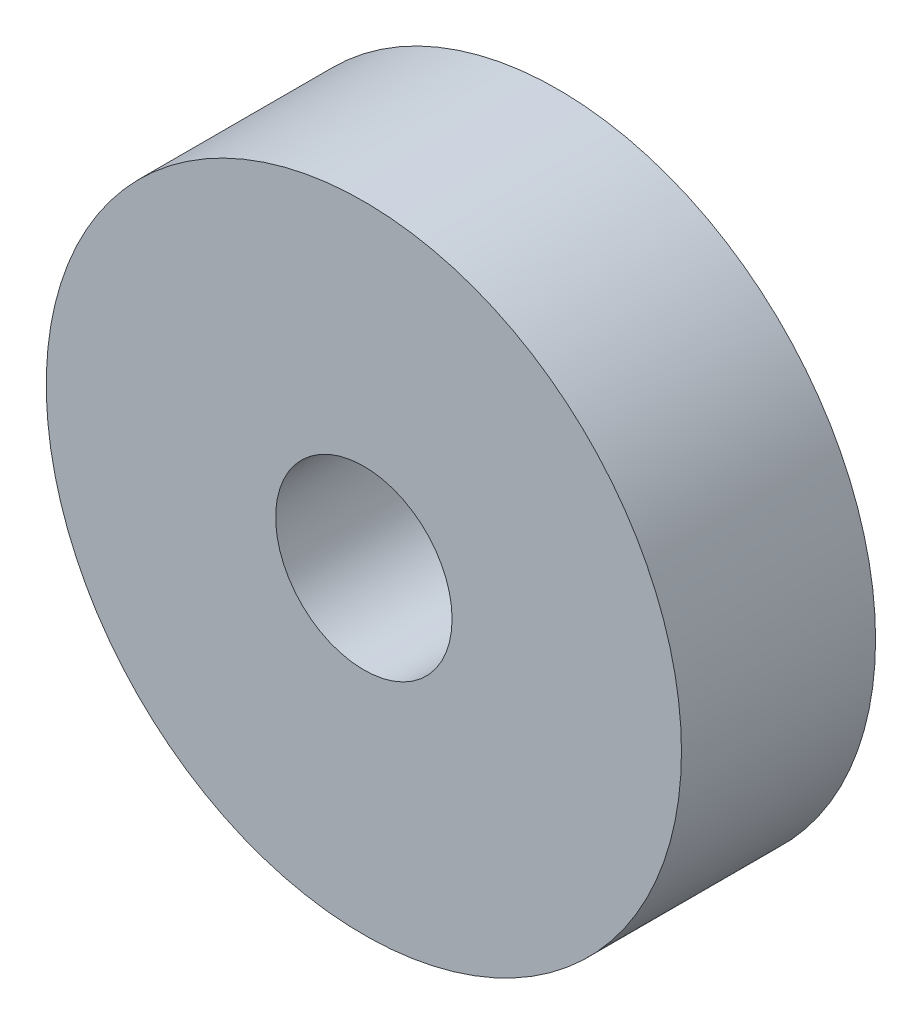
from build123d import *

# Parameters (mm, degrees)
SKETCH1_R           = 9
SKETCH1_R_2         = 2.5
BOSS_EXTRUDE1_DEPTH = 5.5


with BuildPart() as part:
    # Sketch1 → Boss-Extrude1 (new body)
    with BuildSketch(Plane.XY):
        Circle(SKETCH1_R)
        Circle(SKETCH1_R_2, mode=Mode.SUBTRACT)
    extrude(amount=BOSS_EXTRUDE1_DEPTH)


solid = part.part
